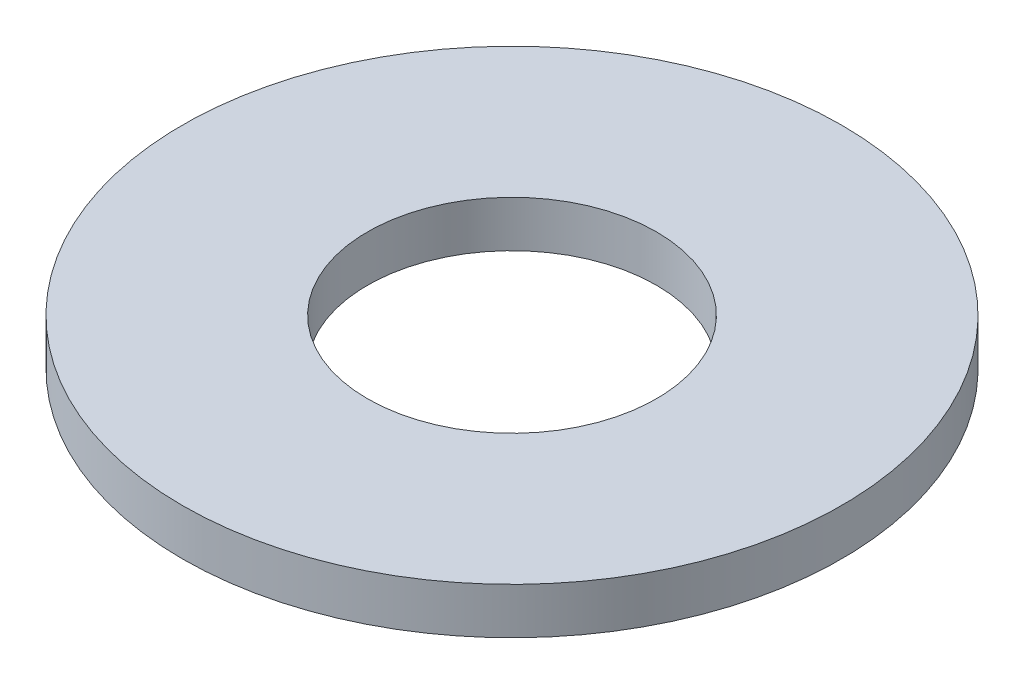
from build123d import *

# Parameters (mm, degrees)
SKETCH1_R           = 18.0975
SKETCH1_R_2         = 7.9375
BOSS_EXTRUDE1_DEPTH = 2.54


with BuildPart() as part:
    # Sketch1 → Boss-Extrude1 (new body)
    with BuildSketch(Plane(origin=(0, 0, 0), x_dir=(1, 0, 0), z_dir=(0, 1, 0))):
        with Locations(Location((0, 0, 0), (0, 0, 270))):
            Circle(SKETCH1_R)
        with Locations(Location((0, 0, 0), (0, 0, 270))):
            Circle(SKETCH1_R_2, mode=Mode.SUBTRACT)
    extrude(amount=BOSS_EXTRUDE1_DEPTH)


solid = part.part
